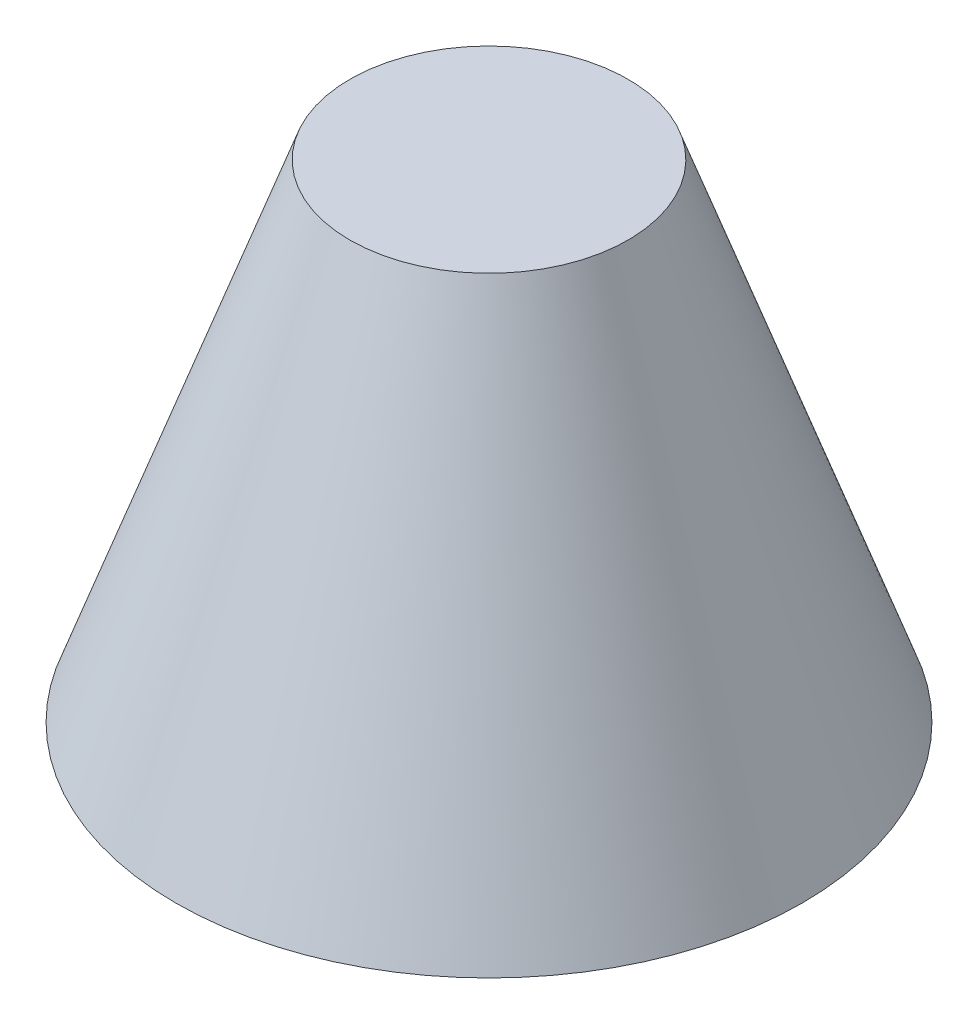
from build123d import *


with BuildPart() as part:
    # Sketch 1 → Revolve 1 (revolve)
    with BuildSketch(Plane(origin=(0, 0, 0), x_dir=(0, 0, -1), z_dir=(1, 0, 0)), mode=Mode.PRIVATE) as revolve_1_sk:
        Polygon((0, 70), (20, 70), (45, 0), (0, 0), align=None)
    revolve(revolve_1_sk.sketch.rotate(Axis((0, 90.572396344, 0), (0, -1, 0)), 180), axis=Axis((0, 90.572396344, 0), (0, -1, 0)))


solid = part.part
